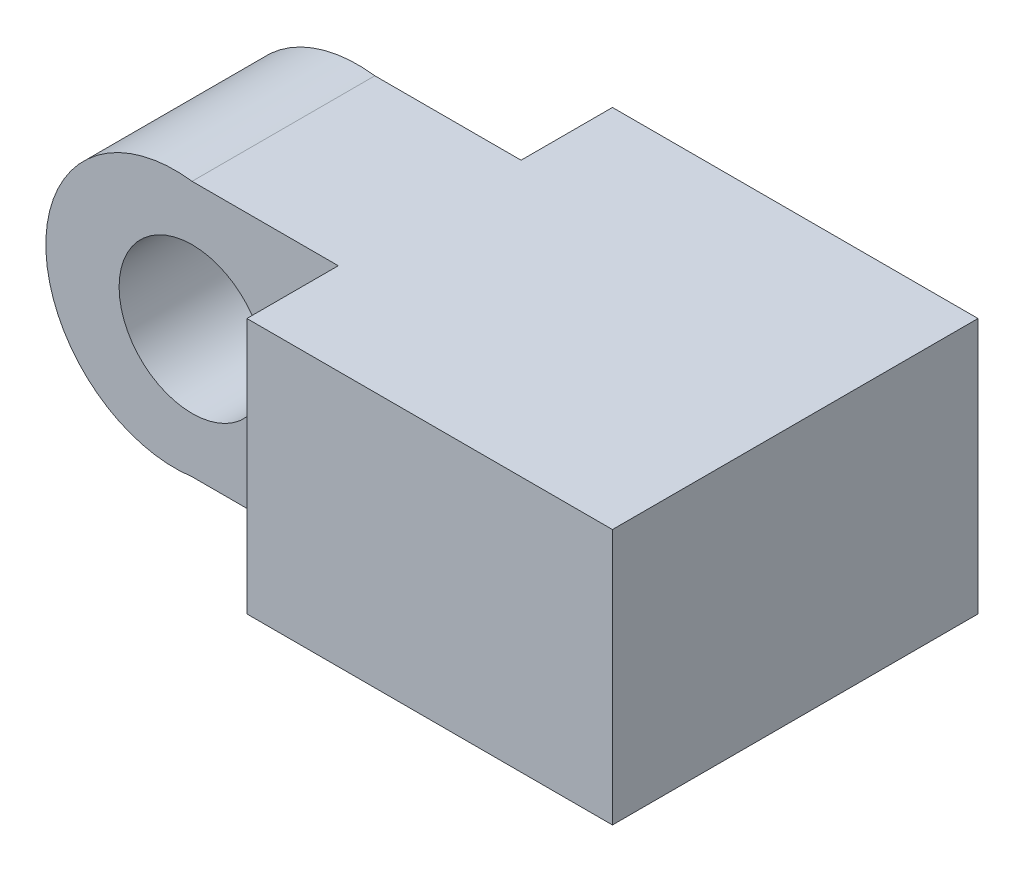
from build123d import *

# Parameters (mm, degrees)
ESQUISSE1_W                  = 10
ESQUISSE1_H                  = 10
BOSS_EXTRU_1_DEPTH           = 7
BOSS_EXTRU_2_DEPTH           = 10
ESQUISSE6_R                  = 2
ENL_V_MAT_EXTRU_1_DEPTH      = 16.793621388
ENL_V_MAT_EXTRU_5_DEPTH      = 16.793621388
ENL_V_MAT_EXTRU_5_DEPTH_BACK = 16.793621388
ESQUISSE8_W                  = 9.997133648
ESQUISSE8_H                  = 2.5
ESQUISSE8_W_2                = 9.640223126


with BuildPart() as part:
    # Esquisse1 → Boss.-Extru.1 (new body)
    with BuildSketch(Plane(origin=(0, 0, 0), x_dir=(1, 0, 0), z_dir=(0, 1, 0))):
        with Locations((5, 5)):
            Rectangle(ESQUISSE1_W, ESQUISSE1_H)
    extrude(amount=BOSS_EXTRU_1_DEPTH)

    # Esquisse2 → Boss.-Extru.2 (add)
    with BuildSketch(Plane.XY):
        with BuildLine():
            Line((0, 7), (0, 0))
            Line((0, 0), (-4, 0))
            ThreePointArc((-4, 0), (-8, 3.5), (-4, 7))
            Line((-4, 7), (0, 7))
        make_face()
    extrude(amount=-BOSS_EXTRU_2_DEPTH)

    # Esquisse6 → Enl_v. mat.-Extru.1 (cut, through all)
    with BuildSketch(Plane.XY):
        with Locations((-3.99631755, 3.5)):
            Circle(ESQUISSE6_R)
    extrude(amount=-ENL_V_MAT_EXTRU_1_DEPTH, mode=Mode.SUBTRACT)

    # Esquisse8 → Enl_v. mat.-Extru.5 (cut, two sides: drawn at the far end of the back side and taken through both)
    with BuildSketch(Plane(origin=(0, 0, 0), x_dir=(1, 0, 0), z_dir=(0, 1, 0)).offset(-ENL_V_MAT_EXTRU_5_DEPTH_BACK)):
        with Locations((-4.998566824, 1.25)):
            Rectangle(ESQUISSE8_W, ESQUISSE8_H)
        with Locations((-4.820111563, 8.75)):
            Rectangle(ESQUISSE8_W_2, ESQUISSE8_H)
    extrude(amount=ENL_V_MAT_EXTRU_5_DEPTH + ENL_V_MAT_EXTRU_5_DEPTH_BACK, mode=Mode.SUBTRACT)


solid = part.part
